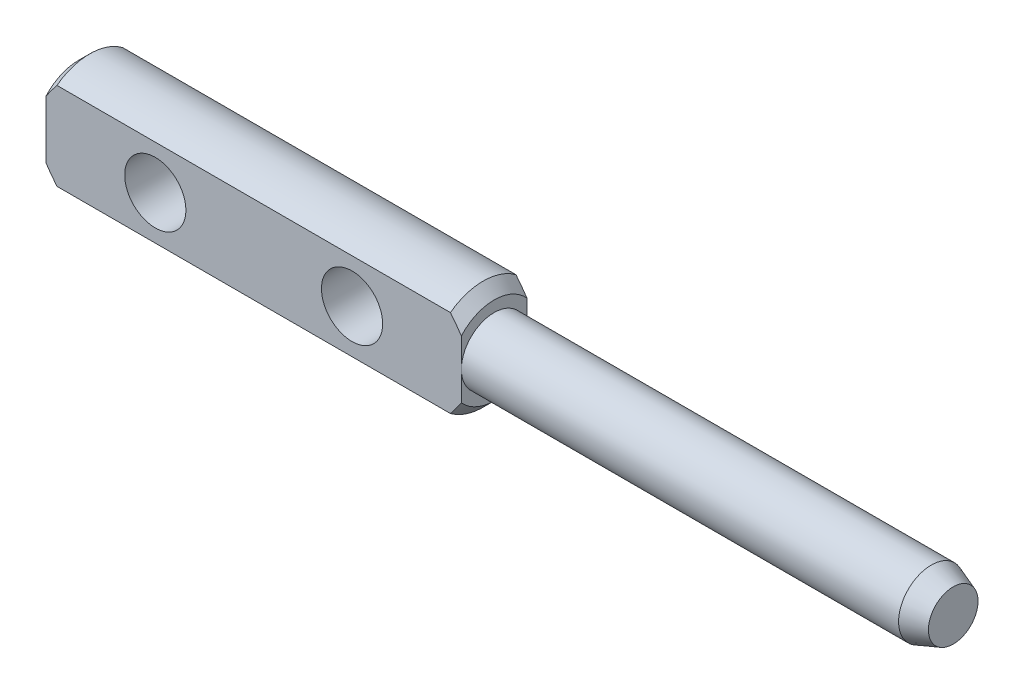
from build123d import *

# Parameters (mm, degrees)
SKETCH2_OUTSIDE_W   = 15.124
SKETCH2_OUTSIDE_H   = 15.124
SKETCH2_OUTSIDE_W_2 = 3
SKETCH2_OUTSIDE_H_2 = 5
CUT_EXTRUDE1_DEPTH  = 19
SKETCH4_R           = 1.4
CUT_EXTRUDE2_DEPTH  = 41.190172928


with BuildPart() as part:
    # Sketch1 → Revolve1 (revolve)
    with BuildSketch(Plane.XY, mode=Mode.PRIVATE) as revolve1_sk:
        Polygon((0, 0), (0, 2), (0.5, 2.5), (18.5, 2.5), (19, 2), (19, 1.5), (39, 1.5), (40, 1.136029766), (40, 0), align=None)
    revolve(revolve1_sk.sketch.rotate(Axis((0, 0, 0), (1, 0, 0)), 90), axis=Axis((0, 0, 0), (1, 0, 0)))

    # Sketch2 outside → Cut-Extrude1 (cut)
    with BuildSketch(Plane.ZY):
        Rectangle(SKETCH2_OUTSIDE_W, SKETCH2_OUTSIDE_H)
        Rectangle(SKETCH2_OUTSIDE_W_2, SKETCH2_OUTSIDE_H_2, mode=Mode.SUBTRACT)
    extrude(amount=-CUT_EXTRUDE1_DEPTH, mode=Mode.SUBTRACT)

    # Sketch4 → Cut-Extrude2 (cut, through all)
    with BuildSketch(Plane.XY.offset(1.5)):
        with Locations((5, 0)):
            Circle(SKETCH4_R)
        with Locations((14, 0)):
            Circle(SKETCH4_R)
    extrude(amount=-CUT_EXTRUDE2_DEPTH, mode=Mode.SUBTRACT)


solid = part.part
